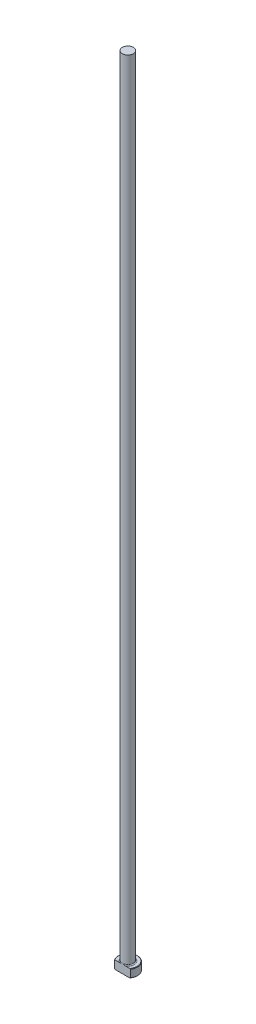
from build123d import *

# Parameters (mm, degrees)
CHAMFER1_SIZE = 0.254
FILLET1_R     = 0.508
KEY_DEPTH     = 458.267364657


with BuildPart() as part:
    # Sketch1 → Revolve1 (revolve)
    with BuildSketch(Plane.XY, mode=Mode.PRIVATE) as revolve1_sk:
        Polygon((0, 0), (-5.5499, 0), (-5.5499, 4.7498), (-3.175, 4.7498), (-3.175, 457.2), (0, 457.2), align=None)
    revolve(revolve1_sk.sketch.rotate(Axis((0, 259.958771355, 0), (0, -1, 0)), 270), axis=Axis((0, 259.958771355, 0), (0, -1, 0)))

    # Chamfer1
    chamfer1_edges = [part.edges().sort_by_distance(p)[0] for p in [
        (0, 4.7498, -5.5499),
        (0, 0, -5.5499),
    ]]
    chamfer(chamfer1_edges, length=CHAMFER1_SIZE)

    # Fillet1
    fillet1_edges = [part.edges().sort_by_distance(p)[0] for p in [
        (0, 4.7498, -3.175),
    ]]
    fillet(fillet1_edges, radius=FILLET1_R)

    # Sketch2 → KEY (cut, through all)
    with BuildSketch(Plane.XZ):
        with BuildLine():
            Line((-4.552006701, 3.175), (4.552006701, 3.175))
            ThreePointArc((4.552006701, 3.175), (0, 5.5499), (-4.552006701, 3.175))
        make_face()
    extrude(amount=-KEY_DEPTH, mode=Mode.SUBTRACT)


solid = part.part
